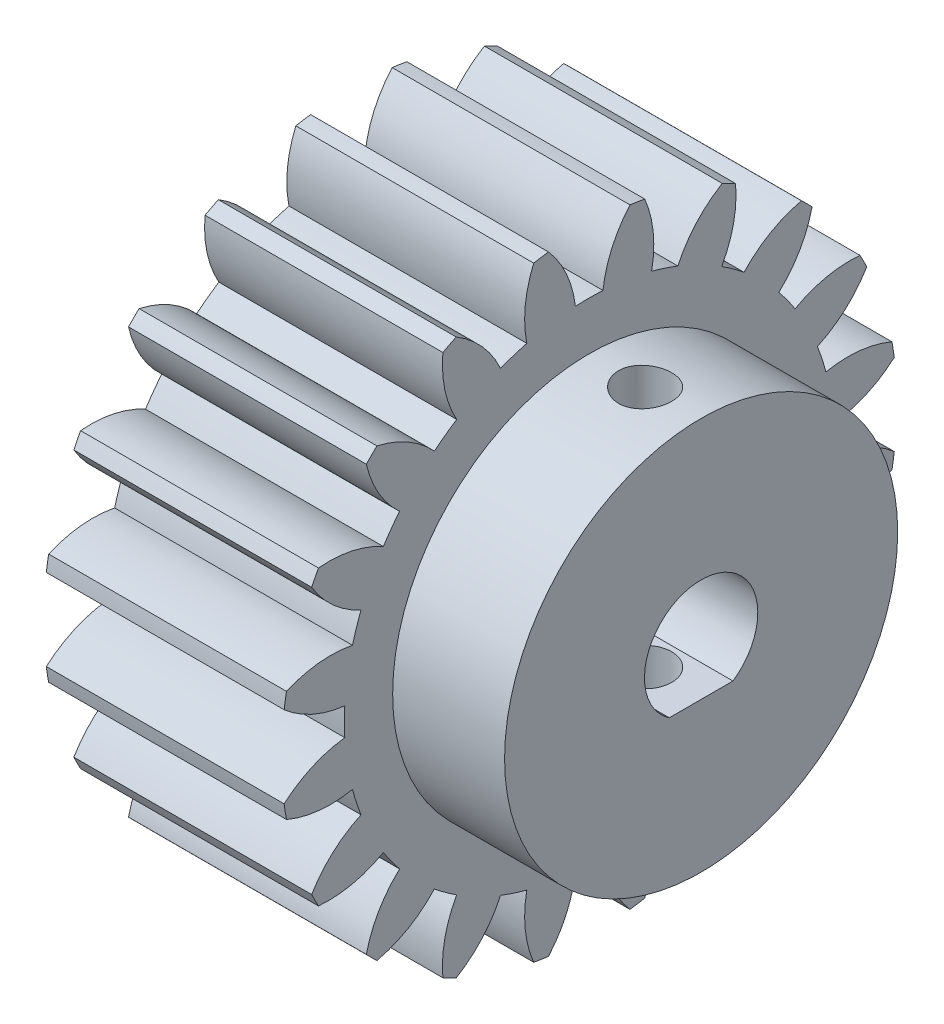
from build123d import *

# Parameters (mm, degrees)
BASPROSKE_W                = 17
BASPROSKE_H                = 22
TOOTHCUT_DEPTH             = 36.454195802
TEETHCUTS_COUNT            = 20
TEETHCUTS_ANGLE            = 342
BORSKE_R                   = 0.4
BORE_DEPTH                 = 50.0000508
CROQUIS3_R                 = 14.05
SALIENTE_EXTRUIR2_DEPTH    = 8
CORTAR_EXTRUIR2_DEPTH      = 40.699274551
CORTAR_EXTRUIR2_DEPTH_BACK = 40.699274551
CROQUIS4_R                 = 1.9
CORTAR_EXTRUIR3_START      = -10
CORTAR_EXTRUIR3_DEPTH      = 10


with BuildPart() as part:
    # BasProSke → Base-Revolve (revolve)
    with BuildSketch(Plane(origin=(0, 0, 0), x_dir=(1, 0, 0), z_dir=(0, 1, 0)), mode=Mode.PRIVATE) as base_revolve_sk:
        with Locations((8.5, 11)):
            Rectangle(BASPROSKE_W, BASPROSKE_H)
    revolve(base_revolve_sk.sketch.rotate(Axis((-10, 0, 0), (1, 0, 0)), 180), axis=Axis((-10, 0, 0), (1, 0, 0)))

    # TooCutSke → ToothCut (cut, through all)
    with BuildSketch(Plane(origin=(0, 0, 0), x_dir=(0, 0, -1), z_dir=(1, 0, 0))):
        with BuildLine():
            ThreePointArc((0.986171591, 17.471189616), (0, 17.499), (-0.986171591, 17.471189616))
            ThreePointArc((-0.986171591, 17.471189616), (-1.626916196, 19.798789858), (-2.932850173, 21.829260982))
            ThreePointArc((-2.932850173, 21.829260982), (0, 22.0254), (2.932850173, 21.829260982))
            ThreePointArc((2.932850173, 21.829260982), (1.626916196, 19.798789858), (0.986171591, 17.471189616))
        make_face()
    toothcut = extrude(amount=TOOTHCUT_DEPTH, mode=Mode.SUBTRACT)

    # TeethCuts: ToothCut ×20 about axis
    teethcuts_axis = Axis((-10, 0, 0), (1, 0, 0))
    for i in range(1, TEETHCUTS_COUNT):
        add(toothcut.rotate(teethcuts_axis, i * TEETHCUTS_ANGLE / (TEETHCUTS_COUNT - 1)), mode=Mode.SUBTRACT)

    # BorSke → Bore (cut, symmetric)
    with BuildSketch(Plane(origin=(0, 0, 0), x_dir=(0, 0, -1), z_dir=(1, 0, 0))):
        with Locations(Location((0, 0, 0), (0, 0, 180))):
            Circle(BORSKE_R)
    extrude(amount=BORE_DEPTH, both=True, mode=Mode.SUBTRACT)

    # Croquis3 → Saliente-Extruir2 (add)
    with BuildSketch(Plane(origin=(17, 0, 0), x_dir=(0, 0, -1), z_dir=(1, 0, 0))):
        with Locations(Location((0, 0, 0), (0, 0, 180))):
            Circle(CROQUIS3_R)
        with BuildLine():
            Line((-2.275961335, -3.35), (2.275961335, -3.35))
            ThreePointArc((2.275961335, -3.35), (0, 4.05), (-2.275961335, -3.35))
        make_face(mode=Mode.SUBTRACT)
    extrude(amount=SALIENTE_EXTRUIR2_DEPTH)

    # Croquis4 → Cortar-Extruir2 (cut, two sides: drawn at the far end of the back side and taken through both)
    with BuildSketch(Plane(origin=(0, 0, 0), x_dir=(1, 0, 0), z_dir=(0, 1, 0)).offset(-CORTAR_EXTRUIR2_DEPTH_BACK)):
        with Locations(Location((21, 0, 0), (0, 0, 270))):
            Circle(CROQUIS4_R)
    extrude(amount=CORTAR_EXTRUIR2_DEPTH + CORTAR_EXTRUIR2_DEPTH_BACK, mode=Mode.SUBTRACT)

    # Croquis1 → Cortar-Extruir3 (cut)
    with BuildSketch(Plane(origin=(17, 0, 0), x_dir=(0, 0, -1), z_dir=(1, 0, 0)).offset(CORTAR_EXTRUIR3_START)):
        with BuildLine():
            Line((-2.275961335, -3.35), (2.275961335, -3.35))
            ThreePointArc((2.275961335, -3.35), (0, 4.05), (-2.275961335, -3.35))
        make_face()
    extrude(amount=CORTAR_EXTRUIR3_DEPTH, mode=Mode.SUBTRACT)


solid = part.part
